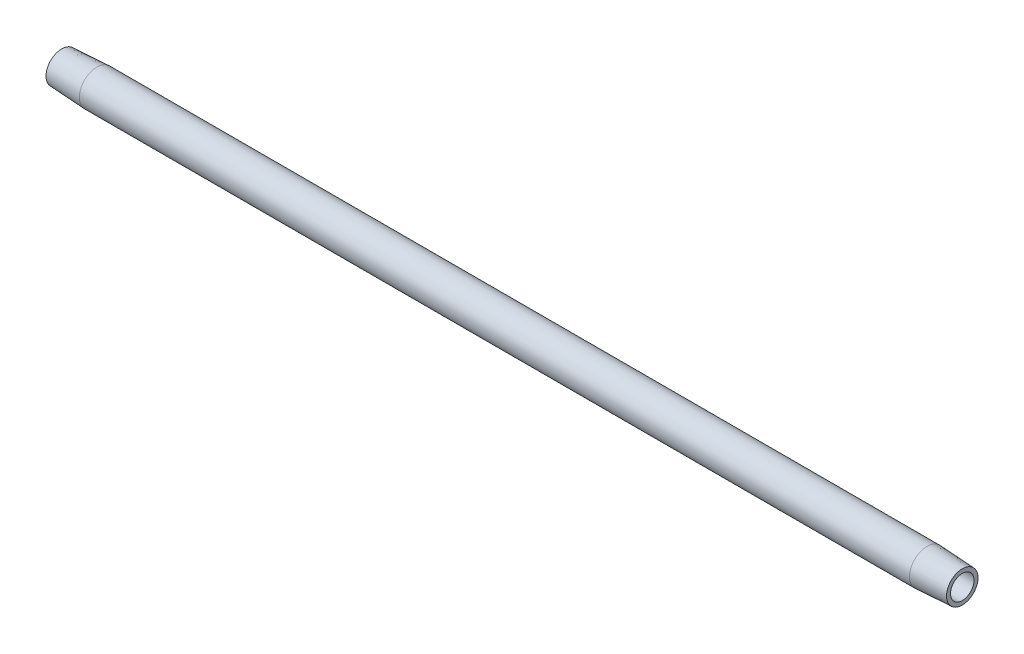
from build123d import *


with BuildPart() as part:
    # Sketch2 → Revolve1 (revolve)
    with BuildSketch(Plane.XY, mode=Mode.PRIVATE) as revolve1_sk:
        Polygon((7.9375, 3.96875), (0, 3.552763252), (0, 2.6543), (203.2, 2.6543), (203.2, 3.552763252), (195.2625, 3.96875), align=None)
    revolve(revolve1_sk.sketch.rotate(Axis((0.476141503, 0, 0), (1, 0, 0)), 90), axis=Axis((0.476141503, 0, 0), (1, 0, 0)))


solid = part.part
